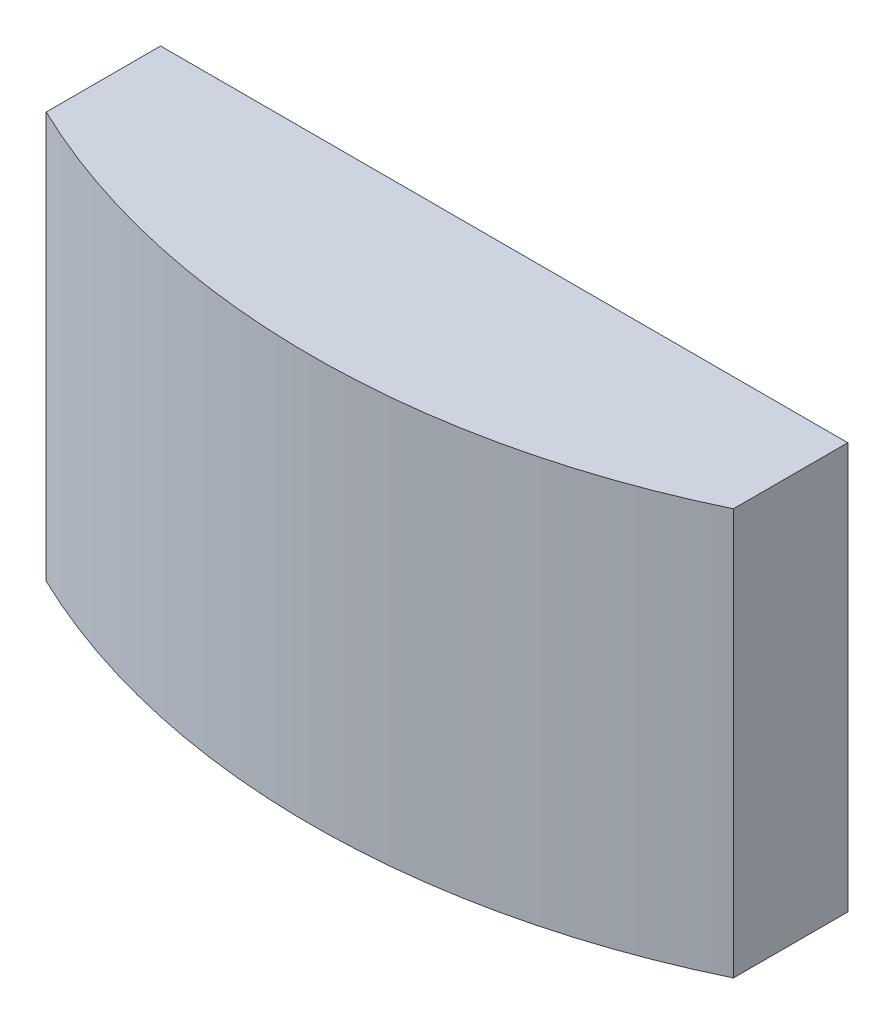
from build123d import *

# Parameters (mm, degrees)
EXTRUDE1_DEPTH = 90.548035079


with BuildPart() as part:
    # Sketch2 → Extrude1 (new body)
    with BuildSketch(Plane(origin=(0, 0, 0), x_dir=(1, 0, 0), z_dir=(0, 1, 0))):
        with BuildLine():
            Line((-76.565504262, 0), (76.565504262, 0))
            Line((76.565504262, 0), (76.565504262, -25.487118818))
            ThreePointArc((76.565504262, -25.487118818), (0, -42.963054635), (-76.565504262, -25.487118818))
            Line((-76.565504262, -25.487118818), (-76.565504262, 0))
        make_face()
    extrude(amount=EXTRUDE1_DEPTH)


solid = part.part
